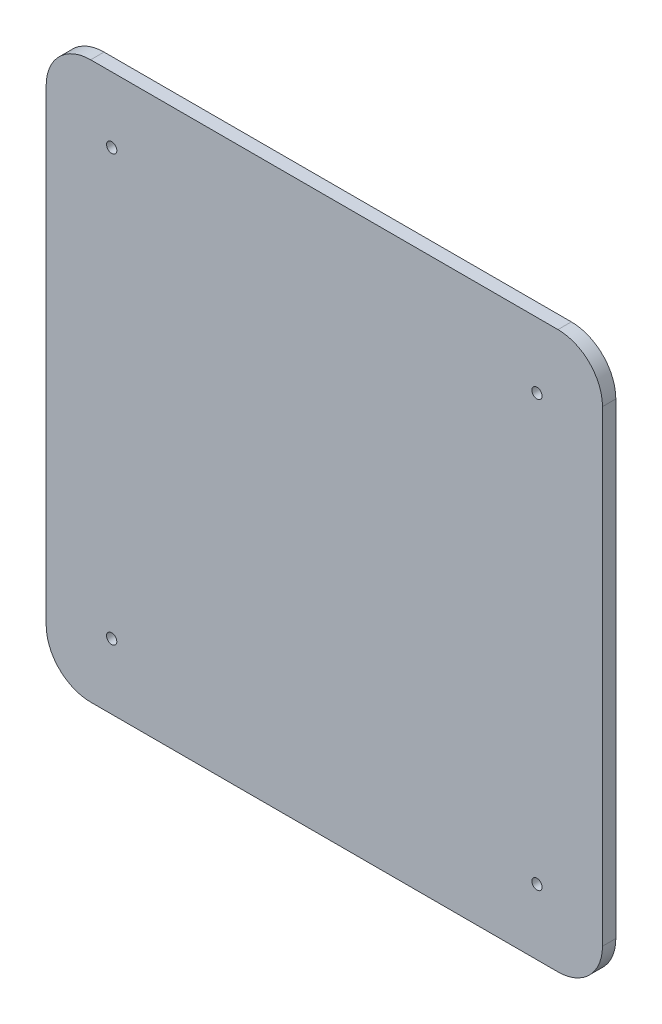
ISO-10303-21;
HEADER;
FILE_DESCRIPTION(('STEP AP214'),'2;1');
FILE_NAME('part.step','',(''),(''),'','','');
FILE_SCHEMA(('AUTOMOTIVE_DESIGN { 1 0 10303 214 1 1 1 1 }'));
ENDSEC;
DATA;
#1=APPLICATION_CONTEXT('core data for automotive mechanical design processes');
#2=APPLICATION_PROTOCOL_DEFINITION('international standard','automotive_design',2000,#1);
#3=PRODUCT_CONTEXT('',#1,'mechanical');
#4=PRODUCT('Part','Part','',(#3));
#5=PRODUCT_RELATED_PRODUCT_CATEGORY('part','',(#4));
#6=PRODUCT_DEFINITION_FORMATION('','',#4);
#7=PRODUCT_DEFINITION_CONTEXT('part definition',#1,'design');
#8=PRODUCT_DEFINITION('design','',#6,#7);
#9=PRODUCT_DEFINITION_SHAPE('','',#8);
#10=(LENGTH_UNIT() NAMED_UNIT(*) SI_UNIT(.MILLI.,.METRE.));
#11=(NAMED_UNIT(*) PLANE_ANGLE_UNIT() SI_UNIT($,.RADIAN.));
#12=(NAMED_UNIT(*) SI_UNIT($,.STERADIAN.) SOLID_ANGLE_UNIT());
#13=UNCERTAINTY_MEASURE_WITH_UNIT(LENGTH_MEASURE(1.E-05),#10,'distance_accuracy_value','');
#14=(GEOMETRIC_REPRESENTATION_CONTEXT(3) GLOBAL_UNCERTAINTY_ASSIGNED_CONTEXT((#13)) GLOBAL_UNIT_ASSIGNED_CONTEXT((#10,
#11,#12)) REPRESENTATION_CONTEXT('',''));
#15=CARTESIAN_POINT('',(0.,0.,0.));
#16=DIRECTION('',(0.,0.,1.));
#17=DIRECTION('',(1.,0.,0.));
#18=AXIS2_PLACEMENT_3D('',#15,#16,#17);
#19=CARTESIAN_POINT('',(0.,125.,3.));
#20=DIRECTION('',(1.,0.,0.));
#21=DIRECTION('',(0.,1.,0.));
#22=AXIS2_PLACEMENT_3D('',#19,#20,#21);
#23=PLANE('',#22);
#24=DIRECTION('',(0.,-1.,0.));
#25=VECTOR('',#24,1.);
#26=CARTESIAN_POINT('',(0.,125.,3.));
#27=LINE('',#26,#25);
#28=CARTESIAN_POINT('',(0.,115.,3.));
#29=VERTEX_POINT('',#28);
#30=CARTESIAN_POINT('',(0.,9.99999999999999,3.));
#31=VERTEX_POINT('',#30);
#32=EDGE_CURVE('E119',#29,#31,#27,.T.);
#33=ORIENTED_EDGE('',*,*,#32,.F.);
#34=DIRECTION('',(0.,0.,-1.));
#35=VECTOR('',#34,1.);
#36=CARTESIAN_POINT('',(0.,115.,3.));
#37=LINE('',#36,#35);
#38=CARTESIAN_POINT('',(0.,115.,0.));
#39=VERTEX_POINT('',#38);
#40=EDGE_CURVE('E104',#29,#39,#37,.T.);
#41=ORIENTED_EDGE('',*,*,#40,.T.);
#42=DIRECTION('',(0.,-1.,0.));
#43=VECTOR('',#42,1.);
#44=CARTESIAN_POINT('',(0.,125.,0.));
#45=LINE('',#44,#43);
#46=CARTESIAN_POINT('',(0.,9.99999999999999,0.));
#47=VERTEX_POINT('',#46);
#48=EDGE_CURVE('E116',#39,#47,#45,.T.);
#49=ORIENTED_EDGE('',*,*,#48,.T.);
#50=DIRECTION('',(0.,0.,-1.));
#51=VECTOR('',#50,1.);
#52=CARTESIAN_POINT('',(0.,9.99999999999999,3.));
#53=LINE('',#52,#51);
#54=EDGE_CURVE('E121',#47,#31,#53,.F.);
#55=ORIENTED_EDGE('',*,*,#54,.T.);
#56=EDGE_LOOP('',(#33,#41,#49,#55));
#57=FACE_BOUND('',#56,.T.);
#58=ADVANCED_FACE('F33',(#57),#23,.F.);
#59=CARTESIAN_POINT('',(0.,0.,3.));
#60=DIRECTION('',(0.,1.,0.));
#61=DIRECTION('',(0.,0.,1.));
#62=AXIS2_PLACEMENT_3D('',#59,#60,#61);
#63=PLANE('',#62);
#64=DIRECTION('',(1.,0.,0.));
#65=VECTOR('',#64,1.);
#66=CARTESIAN_POINT('',(0.,0.,3.));
#67=LINE('',#66,#65);
#68=CARTESIAN_POINT('',(10.,0.,3.));
#69=VERTEX_POINT('',#68);
#70=CARTESIAN_POINT('',(115.,0.,3.));
#71=VERTEX_POINT('',#70);
#72=EDGE_CURVE('E163',#69,#71,#67,.T.);
#73=ORIENTED_EDGE('',*,*,#72,.F.);
#74=DIRECTION('',(0.,0.,-1.));
#75=VECTOR('',#74,1.);
#76=CARTESIAN_POINT('',(10.,0.,3.));
#77=LINE('',#76,#75);
#78=CARTESIAN_POINT('',(10.,0.,0.));
#79=VERTEX_POINT('',#78);
#80=EDGE_CURVE('E11',#69,#79,#77,.T.);
#81=ORIENTED_EDGE('',*,*,#80,.T.);
#82=DIRECTION('',(1.,0.,0.));
#83=VECTOR('',#82,1.);
#84=CARTESIAN_POINT('',(0.,0.,0.));
#85=LINE('',#84,#83);
#86=CARTESIAN_POINT('',(115.,0.,0.));
#87=VERTEX_POINT('',#86);
#88=EDGE_CURVE('E126',#79,#87,#85,.T.);
#89=ORIENTED_EDGE('',*,*,#88,.T.);
#90=DIRECTION('',(0.,0.,-1.));
#91=VECTOR('',#90,1.);
#92=CARTESIAN_POINT('',(115.,0.,3.));
#93=LINE('',#92,#91);
#94=EDGE_CURVE('E41',#87,#71,#93,.F.);
#95=ORIENTED_EDGE('',*,*,#94,.T.);
#96=EDGE_LOOP('',(#73,#81,#89,#95));
#97=FACE_BOUND('',#96,.T.);
#98=ADVANCED_FACE('F162',(#97),#63,.F.);
#99=CARTESIAN_POINT('',(125.,0.,3.));
#100=DIRECTION('',(-1.,0.,0.));
#101=DIRECTION('',(0.,0.,1.));
#102=AXIS2_PLACEMENT_3D('',#99,#100,#101);
#103=PLANE('',#102);
#104=DIRECTION('',(0.,1.,0.));
#105=VECTOR('',#104,1.);
#106=CARTESIAN_POINT('',(125.,0.,0.));
#107=LINE('',#106,#105);
#108=CARTESIAN_POINT('',(125.,10.,0.));
#109=VERTEX_POINT('',#108);
#110=CARTESIAN_POINT('',(125.,115.,0.));
#111=VERTEX_POINT('',#110);
#112=EDGE_CURVE('E130',#109,#111,#107,.T.);
#113=ORIENTED_EDGE('',*,*,#112,.T.);
#114=DIRECTION('',(0.,0.,-1.));
#115=VECTOR('',#114,1.);
#116=CARTESIAN_POINT('',(125.,115.,3.));
#117=LINE('',#116,#115);
#118=CARTESIAN_POINT('',(125.,115.,3.));
#119=VERTEX_POINT('',#118);
#120=EDGE_CURVE('E48',#111,#119,#117,.F.);
#121=ORIENTED_EDGE('',*,*,#120,.T.);
#122=DIRECTION('',(0.,1.,0.));
#123=VECTOR('',#122,1.);
#124=CARTESIAN_POINT('',(125.,0.,3.));
#125=LINE('',#124,#123);
#126=CARTESIAN_POINT('',(125.,10.,3.));
#127=VERTEX_POINT('',#126);
#128=EDGE_CURVE('E169',#127,#119,#125,.T.);
#129=ORIENTED_EDGE('',*,*,#128,.F.);
#130=DIRECTION('',(0.,0.,-1.));
#131=VECTOR('',#130,1.);
#132=CARTESIAN_POINT('',(125.,10.,3.));
#133=LINE('',#132,#131);
#134=EDGE_CURVE('E156',#127,#109,#133,.T.);
#135=ORIENTED_EDGE('',*,*,#134,.T.);
#136=EDGE_LOOP('',(#113,#121,#129,#135));
#137=FACE_BOUND('',#136,.T.);
#138=ADVANCED_FACE('F173',(#137),#103,.F.);
#139=CARTESIAN_POINT('',(125.,125.,3.));
#140=DIRECTION('',(0.,-1.,0.));
#141=DIRECTION('',(0.,0.,-1.));
#142=AXIS2_PLACEMENT_3D('',#139,#140,#141);
#143=PLANE('',#142);
#144=DIRECTION('',(-1.,0.,0.));
#145=VECTOR('',#144,1.);
#146=CARTESIAN_POINT('',(125.,125.,0.));
#147=LINE('',#146,#145);
#148=CARTESIAN_POINT('',(115.,125.,0.));
#149=VERTEX_POINT('',#148);
#150=CARTESIAN_POINT('',(9.99999999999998,125.,0.));
#151=VERTEX_POINT('',#150);
#152=EDGE_CURVE('E140',#149,#151,#147,.T.);
#153=ORIENTED_EDGE('',*,*,#152,.T.);
#154=DIRECTION('',(0.,0.,-1.));
#155=VECTOR('',#154,1.);
#156=CARTESIAN_POINT('',(9.99999999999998,125.,3.));
#157=LINE('',#156,#155);
#158=CARTESIAN_POINT('',(9.99999999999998,125.,3.));
#159=VERTEX_POINT('',#158);
#160=EDGE_CURVE('E105',#151,#159,#157,.F.);
#161=ORIENTED_EDGE('',*,*,#160,.T.);
#162=DIRECTION('',(-1.,0.,0.));
#163=VECTOR('',#162,1.);
#164=CARTESIAN_POINT('',(125.,125.,3.));
#165=LINE('',#164,#163);
#166=CARTESIAN_POINT('',(115.,125.,3.));
#167=VERTEX_POINT('',#166);
#168=EDGE_CURVE('E136',#167,#159,#165,.T.);
#169=ORIENTED_EDGE('',*,*,#168,.F.);
#170=DIRECTION('',(0.,0.,-1.));
#171=VECTOR('',#170,1.);
#172=CARTESIAN_POINT('',(115.,125.,3.));
#173=LINE('',#172,#171);
#174=EDGE_CURVE('E110',#167,#149,#173,.T.);
#175=ORIENTED_EDGE('',*,*,#174,.T.);
#176=EDGE_LOOP('',(#153,#161,#169,#175));
#177=FACE_BOUND('',#176,.T.);
#178=ADVANCED_FACE('F180',(#177),#143,.F.);
#179=CARTESIAN_POINT('',(0.,0.,3.));
#180=DIRECTION('',(0.,0.,1.));
#181=DIRECTION('',(1.,0.,0.));
#182=AXIS2_PLACEMENT_3D('',#179,#180,#181);
#183=PLANE('',#182);
#184=CARTESIAN_POINT('',(14.7210678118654,14.721067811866,3.));
#185=DIRECTION('',(0.,0.,1.));
#186=DIRECTION('',(1.,0.,0.));
#187=AXIS2_PLACEMENT_3D('',#184,#185,#186);
#188=CIRCLE('',#187,1.15000000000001);
#189=CARTESIAN_POINT('',(15.8710678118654,14.721067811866,3.));
#190=VERTEX_POINT('',#189);
#191=EDGE_CURVE('E190',#190,#190,#188,.T.);
#192=ORIENTED_EDGE('',*,*,#191,.F.);
#193=EDGE_LOOP('',(#192));
#194=FACE_BOUND('',#193,.T.);
#195=CARTESIAN_POINT('',(110.278932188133,110.278932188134,3.));
#196=DIRECTION('',(0.,0.,1.));
#197=DIRECTION('',(1.,0.,0.));
#198=AXIS2_PLACEMENT_3D('',#195,#196,#197);
#199=CIRCLE('',#198,1.15);
#200=CARTESIAN_POINT('',(111.428932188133,110.278932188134,3.));
#201=VERTEX_POINT('',#200);
#202=EDGE_CURVE('E189',#201,#201,#199,.T.);
#203=ORIENTED_EDGE('',*,*,#202,.F.);
#204=EDGE_LOOP('',(#203));
#205=FACE_BOUND('',#204,.T.);
#206=CARTESIAN_POINT('',(110.278932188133,14.721067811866,3.));
#207=DIRECTION('',(0.,0.,1.));
#208=DIRECTION('',(1.,0.,0.));
#209=AXIS2_PLACEMENT_3D('',#206,#207,#208);
#210=CIRCLE('',#209,1.15);
#211=CARTESIAN_POINT('',(111.428932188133,14.721067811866,3.));
#212=VERTEX_POINT('',#211);
#213=EDGE_CURVE('E196',#212,#212,#210,.T.);
#214=ORIENTED_EDGE('',*,*,#213,.F.);
#215=EDGE_LOOP('',(#214));
#216=FACE_BOUND('',#215,.T.);
#217=CARTESIAN_POINT('',(14.7210678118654,110.278932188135,3.));
#218=DIRECTION('',(0.,0.,1.));
#219=DIRECTION('',(1.,0.,0.));
#220=AXIS2_PLACEMENT_3D('',#217,#218,#219);
#221=CIRCLE('',#220,1.15000000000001);
#222=CARTESIAN_POINT('',(15.8710678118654,110.278932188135,3.));
#223=VERTEX_POINT('',#222);
#224=EDGE_CURVE('E133',#223,#223,#221,.T.);
#225=ORIENTED_EDGE('',*,*,#224,.F.);
#226=EDGE_LOOP('',(#225));
#227=FACE_BOUND('',#226,.T.);
#228=ORIENTED_EDGE('',*,*,#168,.T.);
#229=CARTESIAN_POINT('',(9.99999999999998,115.,3.));
#230=DIRECTION('',(0.,0.,1.));
#231=DIRECTION('',(1.,0.,0.));
#232=AXIS2_PLACEMENT_3D('',#229,#230,#231);
#233=CIRCLE('',#232,10.);
#234=EDGE_CURVE('E154',#159,#29,#233,.T.);
#235=ORIENTED_EDGE('',*,*,#234,.T.);
#236=ORIENTED_EDGE('',*,*,#32,.T.);
#237=CARTESIAN_POINT('',(10.,10.,3.));
#238=DIRECTION('',(0.,0.,1.));
#239=DIRECTION('',(1.,0.,0.));
#240=AXIS2_PLACEMENT_3D('',#237,#238,#239);
#241=CIRCLE('',#240,10.);
#242=EDGE_CURVE('E150',#31,#69,#241,.T.);
#243=ORIENTED_EDGE('',*,*,#242,.T.);
#244=ORIENTED_EDGE('',*,*,#72,.T.);
#245=CARTESIAN_POINT('',(115.,10.,3.));
#246=DIRECTION('',(0.,0.,1.));
#247=DIRECTION('',(1.,0.,0.));
#248=AXIS2_PLACEMENT_3D('',#245,#246,#247);
#249=CIRCLE('',#248,10.);
#250=EDGE_CURVE('E55',#71,#127,#249,.T.);
#251=ORIENTED_EDGE('',*,*,#250,.T.);
#252=ORIENTED_EDGE('',*,*,#128,.T.);
#253=CARTESIAN_POINT('',(115.,115.,3.));
#254=DIRECTION('',(0.,0.,1.));
#255=DIRECTION('',(1.,0.,0.));
#256=AXIS2_PLACEMENT_3D('',#253,#254,#255);
#257=CIRCLE('',#256,10.);
#258=EDGE_CURVE('E152',#119,#167,#257,.T.);
#259=ORIENTED_EDGE('',*,*,#258,.T.);
#260=EDGE_LOOP('',(#228,#235,#236,#243,#244,#251,#252,#259));
#261=FACE_BOUND('',#260,.T.);
#262=ADVANCED_FACE('F167',(#194,#205,#216,#227,#261),#183,.T.);
#263=CARTESIAN_POINT('',(0.,0.,0.));
#264=DIRECTION('',(0.,0.,1.));
#265=DIRECTION('',(1.,0.,0.));
#266=AXIS2_PLACEMENT_3D('',#263,#264,#265);
#267=PLANE('',#266);
#268=CARTESIAN_POINT('',(14.7210678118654,14.721067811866,0.));
#269=DIRECTION('',(0.,0.,1.));
#270=DIRECTION('',(1.,0.,0.));
#271=AXIS2_PLACEMENT_3D('',#268,#269,#270);
#272=CIRCLE('',#271,1.15000000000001);
#273=CARTESIAN_POINT('',(15.8710678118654,14.721067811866,0.));
#274=VERTEX_POINT('',#273);
#275=EDGE_CURVE('E186',#274,#274,#272,.F.);
#276=ORIENTED_EDGE('',*,*,#275,.F.);
#277=EDGE_LOOP('',(#276));
#278=FACE_BOUND('',#277,.T.);
#279=CARTESIAN_POINT('',(110.278932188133,110.278932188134,0.));
#280=DIRECTION('',(0.,0.,1.));
#281=DIRECTION('',(1.,0.,0.));
#282=AXIS2_PLACEMENT_3D('',#279,#280,#281);
#283=CIRCLE('',#282,1.15);
#284=CARTESIAN_POINT('',(111.428932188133,110.278932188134,0.));
#285=VERTEX_POINT('',#284);
#286=EDGE_CURVE('E193',#285,#285,#283,.F.);
#287=ORIENTED_EDGE('',*,*,#286,.F.);
#288=EDGE_LOOP('',(#287));
#289=FACE_BOUND('',#288,.T.);
#290=CARTESIAN_POINT('',(110.278932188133,14.721067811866,0.));
#291=DIRECTION('',(0.,0.,1.));
#292=DIRECTION('',(1.,0.,0.));
#293=AXIS2_PLACEMENT_3D('',#290,#291,#292);
#294=CIRCLE('',#293,1.15);
#295=CARTESIAN_POINT('',(111.428932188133,14.721067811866,0.));
#296=VERTEX_POINT('',#295);
#297=EDGE_CURVE('E185',#296,#296,#294,.F.);
#298=ORIENTED_EDGE('',*,*,#297,.F.);
#299=EDGE_LOOP('',(#298));
#300=FACE_BOUND('',#299,.T.);
#301=CARTESIAN_POINT('',(14.7210678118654,110.278932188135,0.));
#302=DIRECTION('',(0.,0.,1.));
#303=DIRECTION('',(1.,0.,0.));
#304=AXIS2_PLACEMENT_3D('',#301,#302,#303);
#305=CIRCLE('',#304,1.15000000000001);
#306=CARTESIAN_POINT('',(15.8710678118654,110.278932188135,0.));
#307=VERTEX_POINT('',#306);
#308=EDGE_CURVE('E127',#307,#307,#305,.F.);
#309=ORIENTED_EDGE('',*,*,#308,.F.);
#310=EDGE_LOOP('',(#309));
#311=FACE_BOUND('',#310,.T.);
#312=ORIENTED_EDGE('',*,*,#48,.F.);
#313=CARTESIAN_POINT('',(9.99999999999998,115.,0.));
#314=DIRECTION('',(0.,0.,1.));
#315=DIRECTION('',(1.,0.,0.));
#316=AXIS2_PLACEMENT_3D('',#313,#314,#315);
#317=CIRCLE('',#316,10.);
#318=EDGE_CURVE('E100',#39,#151,#317,.F.);
#319=ORIENTED_EDGE('',*,*,#318,.T.);
#320=ORIENTED_EDGE('',*,*,#152,.F.);
#321=CARTESIAN_POINT('',(115.,115.,0.));
#322=DIRECTION('',(0.,0.,1.));
#323=DIRECTION('',(1.,0.,0.));
#324=AXIS2_PLACEMENT_3D('',#321,#322,#323);
#325=CIRCLE('',#324,10.);
#326=EDGE_CURVE('E111',#149,#111,#325,.F.);
#327=ORIENTED_EDGE('',*,*,#326,.T.);
#328=ORIENTED_EDGE('',*,*,#112,.F.);
#329=CARTESIAN_POINT('',(115.,10.,0.));
#330=DIRECTION('',(0.,0.,1.));
#331=DIRECTION('',(1.,0.,0.));
#332=AXIS2_PLACEMENT_3D('',#329,#330,#331);
#333=CIRCLE('',#332,10.);
#334=EDGE_CURVE('E120',#109,#87,#333,.F.);
#335=ORIENTED_EDGE('',*,*,#334,.T.);
#336=ORIENTED_EDGE('',*,*,#88,.F.);
#337=CARTESIAN_POINT('',(10.,10.,0.));
#338=DIRECTION('',(0.,0.,1.));
#339=DIRECTION('',(1.,0.,0.));
#340=AXIS2_PLACEMENT_3D('',#337,#338,#339);
#341=CIRCLE('',#340,10.);
#342=EDGE_CURVE('E125',#79,#47,#341,.F.);
#343=ORIENTED_EDGE('',*,*,#342,.T.);
#344=EDGE_LOOP('',(#312,#319,#320,#327,#328,#335,#336,#343));
#345=FACE_BOUND('',#344,.T.);
#346=ADVANCED_FACE('F123',(#278,#289,#300,#311,#345),#267,.F.);
#347=CARTESIAN_POINT('',(9.99999999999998,115.,3.));
#348=DIRECTION('',(0.,0.,-1.));
#349=DIRECTION('',(-1.,0.,0.));
#350=AXIS2_PLACEMENT_3D('',#347,#348,#349);
#351=CYLINDRICAL_SURFACE('',#350,10.);
#352=ORIENTED_EDGE('',*,*,#234,.F.);
#353=ORIENTED_EDGE('',*,*,#160,.F.);
#354=ORIENTED_EDGE('',*,*,#318,.F.);
#355=ORIENTED_EDGE('',*,*,#40,.F.);
#356=EDGE_LOOP('',(#352,#353,#354,#355));
#357=FACE_BOUND('',#356,.T.);
#358=ADVANCED_FACE('F103',(#357),#351,.T.);
#359=CARTESIAN_POINT('',(115.,115.,3.));
#360=DIRECTION('',(0.,0.,-1.));
#361=DIRECTION('',(-1.,0.,0.));
#362=AXIS2_PLACEMENT_3D('',#359,#360,#361);
#363=CYLINDRICAL_SURFACE('',#362,10.);
#364=ORIENTED_EDGE('',*,*,#258,.F.);
#365=ORIENTED_EDGE('',*,*,#120,.F.);
#366=ORIENTED_EDGE('',*,*,#326,.F.);
#367=ORIENTED_EDGE('',*,*,#174,.F.);
#368=EDGE_LOOP('',(#364,#365,#366,#367));
#369=FACE_BOUND('',#368,.T.);
#370=ADVANCED_FACE('F177',(#369),#363,.T.);
#371=CARTESIAN_POINT('',(10.,10.,3.));
#372=DIRECTION('',(0.,0.,-1.));
#373=DIRECTION('',(-1.,0.,0.));
#374=AXIS2_PLACEMENT_3D('',#371,#372,#373);
#375=CYLINDRICAL_SURFACE('',#374,10.);
#376=ORIENTED_EDGE('',*,*,#242,.F.);
#377=ORIENTED_EDGE('',*,*,#54,.F.);
#378=ORIENTED_EDGE('',*,*,#342,.F.);
#379=ORIENTED_EDGE('',*,*,#80,.F.);
#380=EDGE_LOOP('',(#376,#377,#378,#379));
#381=FACE_BOUND('',#380,.T.);
#382=ADVANCED_FACE('F223',(#381),#375,.T.);
#383=CARTESIAN_POINT('',(115.,10.,3.));
#384=DIRECTION('',(0.,0.,-1.));
#385=DIRECTION('',(-1.,0.,0.));
#386=AXIS2_PLACEMENT_3D('',#383,#384,#385);
#387=CYLINDRICAL_SURFACE('',#386,10.);
#388=ORIENTED_EDGE('',*,*,#250,.F.);
#389=ORIENTED_EDGE('',*,*,#94,.F.);
#390=ORIENTED_EDGE('',*,*,#334,.F.);
#391=ORIENTED_EDGE('',*,*,#134,.F.);
#392=EDGE_LOOP('',(#388,#389,#390,#391));
#393=FACE_BOUND('',#392,.T.);
#394=ADVANCED_FACE('F35',(#393),#387,.T.);
#395=CARTESIAN_POINT('',(14.7210678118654,110.278932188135,-3.25269119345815));
#396=DIRECTION('',(0.,0.,1.));
#397=DIRECTION('',(1.,0.,0.));
#398=AXIS2_PLACEMENT_3D('',#395,#396,#397);
#399=CYLINDRICAL_SURFACE('',#398,1.15000000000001);
#400=ORIENTED_EDGE('',*,*,#308,.T.);
#401=EDGE_LOOP('',(#400));
#402=FACE_BOUND('',#401,.T.);
#403=ORIENTED_EDGE('',*,*,#224,.T.);
#404=EDGE_LOOP('',(#403));
#405=FACE_BOUND('',#404,.T.);
#406=ADVANCED_FACE('F212',(#402,#405),#399,.F.);
#407=CARTESIAN_POINT('',(110.278932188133,14.721067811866,-3.25269119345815));
#408=DIRECTION('',(0.,0.,1.));
#409=DIRECTION('',(1.,0.,0.));
#410=AXIS2_PLACEMENT_3D('',#407,#408,#409);
#411=CYLINDRICAL_SURFACE('',#410,1.15);
#412=ORIENTED_EDGE('',*,*,#297,.T.);
#413=EDGE_LOOP('',(#412));
#414=FACE_BOUND('',#413,.T.);
#415=ORIENTED_EDGE('',*,*,#213,.T.);
#416=EDGE_LOOP('',(#415));
#417=FACE_BOUND('',#416,.T.);
#418=ADVANCED_FACE('F204',(#414,#417),#411,.F.);
#419=CARTESIAN_POINT('',(110.278932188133,110.278932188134,-3.25269119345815));
#420=DIRECTION('',(0.,0.,1.));
#421=DIRECTION('',(1.,0.,0.));
#422=AXIS2_PLACEMENT_3D('',#419,#420,#421);
#423=CYLINDRICAL_SURFACE('',#422,1.15);
#424=ORIENTED_EDGE('',*,*,#286,.T.);
#425=EDGE_LOOP('',(#424));
#426=FACE_BOUND('',#425,.T.);
#427=ORIENTED_EDGE('',*,*,#202,.T.);
#428=EDGE_LOOP('',(#427));
#429=FACE_BOUND('',#428,.T.);
#430=ADVANCED_FACE('F220',(#426,#429),#423,.F.);
#431=CARTESIAN_POINT('',(14.7210678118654,14.721067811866,-3.25269119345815));
#432=DIRECTION('',(0.,0.,1.));
#433=DIRECTION('',(1.,0.,0.));
#434=AXIS2_PLACEMENT_3D('',#431,#432,#433);
#435=CYLINDRICAL_SURFACE('',#434,1.15000000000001);
#436=ORIENTED_EDGE('',*,*,#275,.T.);
#437=EDGE_LOOP('',(#436));
#438=FACE_BOUND('',#437,.T.);
#439=ORIENTED_EDGE('',*,*,#191,.T.);
#440=EDGE_LOOP('',(#439));
#441=FACE_BOUND('',#440,.T.);
#442=ADVANCED_FACE('F283',(#438,#441),#435,.F.);
#443=CLOSED_SHELL('',(#58,#98,#138,#178,#262,#346,#358,#370,#382,#394,#406,#418,#430,#442));
#444=MANIFOLD_SOLID_BREP('B2',#443);
#445=ADVANCED_BREP_SHAPE_REPRESENTATION('',(#18,#444),#14);
#446=SHAPE_DEFINITION_REPRESENTATION(#9,#445);
ENDSEC;
END-ISO-10303-21;
